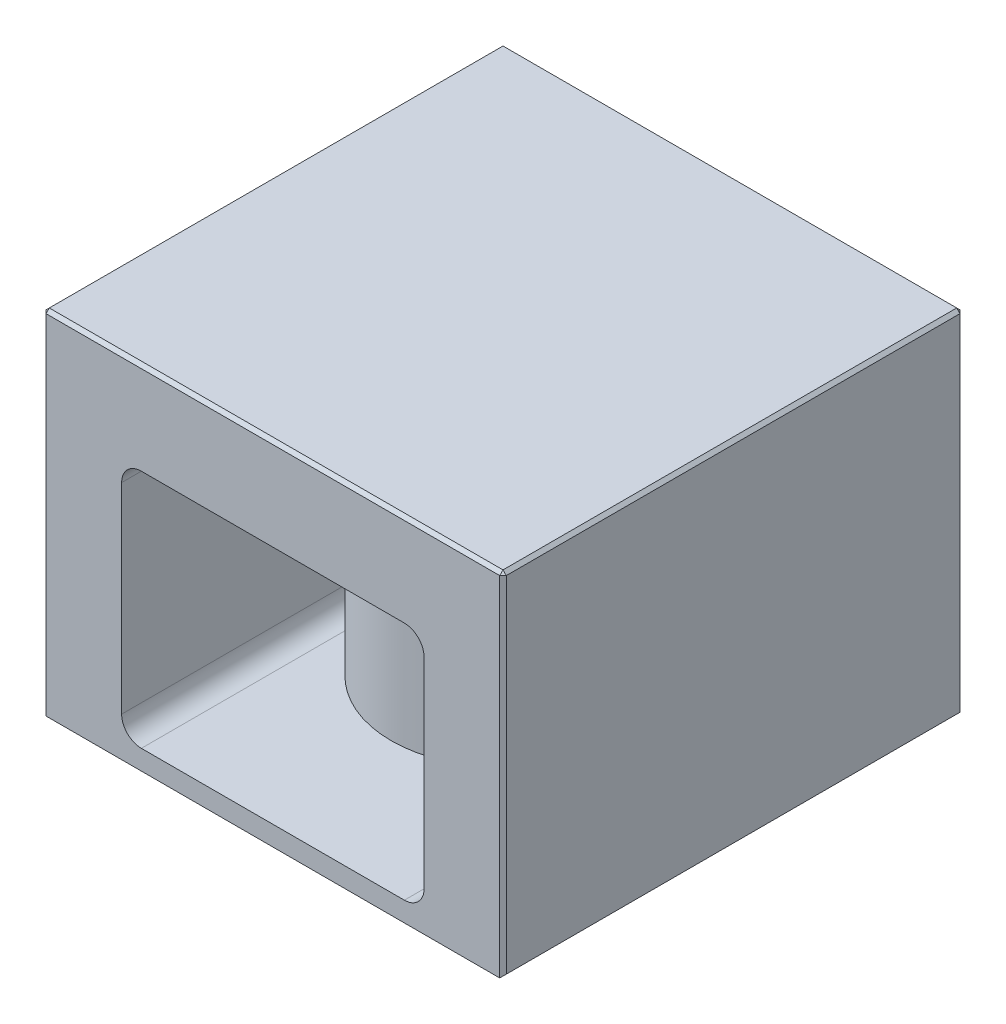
ISO-10303-21;
HEADER;
FILE_DESCRIPTION(('STEP AP214'),'2;1');
FILE_NAME('part.step','',(''),(''),'','','');
FILE_SCHEMA(('AUTOMOTIVE_DESIGN { 1 0 10303 214 1 1 1 1 }'));
ENDSEC;
DATA;
#1=APPLICATION_CONTEXT('core data for automotive mechanical design processes');
#2=APPLICATION_PROTOCOL_DEFINITION('international standard','automotive_design',2000,#1);
#3=PRODUCT_CONTEXT('',#1,'mechanical');
#4=PRODUCT('Part','Part','',(#3));
#5=PRODUCT_RELATED_PRODUCT_CATEGORY('part','',(#4));
#6=PRODUCT_DEFINITION_FORMATION('','',#4);
#7=PRODUCT_DEFINITION_CONTEXT('part definition',#1,'design');
#8=PRODUCT_DEFINITION('design','',#6,#7);
#9=PRODUCT_DEFINITION_SHAPE('','',#8);
#10=(LENGTH_UNIT() NAMED_UNIT(*) SI_UNIT(.MILLI.,.METRE.));
#11=(NAMED_UNIT(*) PLANE_ANGLE_UNIT() SI_UNIT($,.RADIAN.));
#12=(NAMED_UNIT(*) SI_UNIT($,.STERADIAN.) SOLID_ANGLE_UNIT());
#13=UNCERTAINTY_MEASURE_WITH_UNIT(LENGTH_MEASURE(1.E-05),#10,'distance_accuracy_value','');
#14=(GEOMETRIC_REPRESENTATION_CONTEXT(3) GLOBAL_UNCERTAINTY_ASSIGNED_CONTEXT((#13)) GLOBAL_UNIT_ASSIGNED_CONTEXT((#10,
#11,#12)) REPRESENTATION_CONTEXT('',''));
#15=CARTESIAN_POINT('',(0.,0.,0.));
#16=DIRECTION('',(0.,0.,1.));
#17=DIRECTION('',(1.,0.,0.));
#18=AXIS2_PLACEMENT_3D('',#15,#16,#17);
#19=CARTESIAN_POINT('',(0.,-98.5832611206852,0.));
#20=DIRECTION('',(0.,1.,0.));
#21=DIRECTION('',(0.,0.,1.));
#22=AXIS2_PLACEMENT_3D('',#19,#20,#21);
#23=CYLINDRICAL_SURFACE('',#22,17.);
#24=CARTESIAN_POINT('',(0.,-15.5,0.));
#25=DIRECTION('',(0.,-1.,0.));
#26=DIRECTION('',(0.,0.,-1.));
#27=AXIS2_PLACEMENT_3D('',#24,#25,#26);
#28=CIRCLE('',#27,17.);
#29=CARTESIAN_POINT('',(0.,-15.5,-17.));
#30=VERTEX_POINT('',#29);
#31=EDGE_CURVE('E52',#30,#30,#28,.T.);
#32=ORIENTED_EDGE('',*,*,#31,.T.);
#33=EDGE_LOOP('',(#32));
#34=FACE_BOUND('',#33,.T.);
#35=CARTESIAN_POINT('',(0.,-48.5,0.));
#36=DIRECTION('',(0.,-1.,0.));
#37=DIRECTION('',(0.,0.,-1.));
#38=AXIS2_PLACEMENT_3D('',#35,#36,#37);
#39=CIRCLE('',#38,17.);
#40=CARTESIAN_POINT('',(0.,-48.5,-17.));
#41=VERTEX_POINT('',#40);
#42=EDGE_CURVE('E12',#41,#41,#39,.T.);
#43=ORIENTED_EDGE('',*,*,#42,.F.);
#44=EDGE_LOOP('',(#43));
#45=FACE_BOUND('',#44,.T.);
#46=ADVANCED_FACE('F45',(#34,#45),#23,.T.);
#47=CARTESIAN_POINT('',(0.,-15.5,0.));
#48=DIRECTION('',(0.,-1.,0.));
#49=DIRECTION('',(0.,0.,-1.));
#50=AXIS2_PLACEMENT_3D('',#47,#48,#49);
#51=PLANE('',#50);
#52=ORIENTED_EDGE('',*,*,#31,.F.);
#53=EDGE_LOOP('',(#52));
#54=FACE_BOUND('',#53,.T.);
#55=ADVANCED_FACE('F60',(#54),#51,.F.);
#56=CARTESIAN_POINT('',(-20.,-48.5,-93.7218017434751));
#57=DIRECTION('',(0.,-1.,0.));
#58=DIRECTION('',(0.,0.,-1.));
#59=AXIS2_PLACEMENT_3D('',#56,#57,#58);
#60=PLANE('',#59);
#61=ORIENTED_EDGE('',*,*,#42,.T.);
#62=EDGE_LOOP('',(#61));
#63=FACE_BOUND('',#62,.T.);
#64=ADVANCED_FACE('F47',(#63),#60,.T.);
#65=CLOSED_SHELL('',(#46,#55,#64));
#66=MANIFOLD_SOLID_BREP('B2',#65);
#67=CARTESIAN_POINT('',(35.,-53.5,35.));
#68=DIRECTION('',(1.,0.,0.));
#69=DIRECTION('',(0.,0.,-1.));
#70=AXIS2_PLACEMENT_3D('',#67,#68,#69);
#71=PLANE('',#70);
#72=DIRECTION('',(0.,0.,-1.));
#73=VECTOR('',#72,1.);
#74=CARTESIAN_POINT('',(35.,-53.,35.));
#75=LINE('',#74,#73);
#76=CARTESIAN_POINT('',(35.,-53.,34.5));
#77=VERTEX_POINT('',#76);
#78=CARTESIAN_POINT('',(35.,-53.,-34.5));
#79=VERTEX_POINT('',#78);
#80=EDGE_CURVE('E280',#77,#79,#75,.T.);
#81=ORIENTED_EDGE('',*,*,#80,.T.);
#82=DIRECTION('',(0.,1.,0.));
#83=VECTOR('',#82,1.);
#84=CARTESIAN_POINT('',(35.,-53.5,-34.5));
#85=LINE('',#84,#83);
#86=CARTESIAN_POINT('',(35.,-0.500000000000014,-34.5));
#87=VERTEX_POINT('',#86);
#88=EDGE_CURVE('E282',#79,#87,#85,.T.);
#89=ORIENTED_EDGE('',*,*,#88,.T.);
#90=DIRECTION('',(0.,0.,1.));
#91=VECTOR('',#90,1.);
#92=CARTESIAN_POINT('',(35.,-0.500000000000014,35.));
#93=LINE('',#92,#91);
#94=CARTESIAN_POINT('',(35.,-0.500000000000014,34.5));
#95=VERTEX_POINT('',#94);
#96=EDGE_CURVE('E276',#87,#95,#93,.T.);
#97=ORIENTED_EDGE('',*,*,#96,.T.);
#98=DIRECTION('',(0.,-1.,0.));
#99=VECTOR('',#98,1.);
#100=CARTESIAN_POINT('',(35.,-53.5,34.5));
#101=LINE('',#100,#99);
#102=EDGE_CURVE('E278',#95,#77,#101,.T.);
#103=ORIENTED_EDGE('',*,*,#102,.T.);
#104=EDGE_LOOP('',(#81,#89,#97,#103));
#105=FACE_BOUND('',#104,.T.);
#106=ADVANCED_FACE('F86',(#105),#71,.T.);
#107=CARTESIAN_POINT('',(-35.,-53.5,35.));
#108=DIRECTION('',(0.,0.,1.));
#109=DIRECTION('',(1.,0.,0.));
#110=AXIS2_PLACEMENT_3D('',#107,#108,#109);
#111=PLANE('',#110);
#112=DIRECTION('',(1.,0.,0.));
#113=VECTOR('',#112,1.);
#114=CARTESIAN_POINT('',(-35.,-53.5,35.));
#115=LINE('',#114,#113);
#116=CARTESIAN_POINT('',(-34.5,-53.5,35.));
#117=VERTEX_POINT('',#116);
#118=CARTESIAN_POINT('',(34.5,-53.5,35.));
#119=VERTEX_POINT('',#118);
#120=EDGE_CURVE('E273',#117,#119,#115,.T.);
#121=ORIENTED_EDGE('',*,*,#120,.T.);
#122=DIRECTION('',(0.,1.,0.));
#123=VECTOR('',#122,1.);
#124=CARTESIAN_POINT('',(34.5,-53.5,35.));
#125=LINE('',#124,#123);
#126=CARTESIAN_POINT('',(34.5,-0.500000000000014,35.));
#127=VERTEX_POINT('',#126);
#128=EDGE_CURVE('E300',#119,#127,#125,.T.);
#129=ORIENTED_EDGE('',*,*,#128,.T.);
#130=DIRECTION('',(-1.,0.,0.));
#131=VECTOR('',#130,1.);
#132=CARTESIAN_POINT('',(-35.,-0.500000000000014,35.));
#133=LINE('',#132,#131);
#134=CARTESIAN_POINT('',(-34.5,-0.500000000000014,35.));
#135=VERTEX_POINT('',#134);
#136=EDGE_CURVE('E296',#127,#135,#133,.T.);
#137=ORIENTED_EDGE('',*,*,#136,.T.);
#138=DIRECTION('',(0.,-1.,0.));
#139=VECTOR('',#138,1.);
#140=CARTESIAN_POINT('',(-34.5,-53.5,35.));
#141=LINE('',#140,#139);
#142=EDGE_CURVE('E298',#135,#117,#141,.T.);
#143=ORIENTED_EDGE('',*,*,#142,.T.);
#144=EDGE_LOOP('',(#121,#129,#137,#143));
#145=FACE_BOUND('',#144,.T.);
#146=DIRECTION('',(-1.,0.,0.));
#147=VECTOR('',#146,1.);
#148=CARTESIAN_POINT('',(-20.,-14.,35.));
#149=LINE('',#148,#147);
#150=CARTESIAN_POINT('',(20.,-14.,35.));
#151=VERTEX_POINT('',#150);
#152=CARTESIAN_POINT('',(-20.,-14.,35.));
#153=VERTEX_POINT('',#152);
#154=EDGE_CURVE('E227',#151,#153,#149,.T.);
#155=ORIENTED_EDGE('',*,*,#154,.F.);
#156=CARTESIAN_POINT('',(20.,-17.,35.));
#157=DIRECTION('',(0.,0.,1.));
#158=DIRECTION('',(-1.,0.,0.));
#159=AXIS2_PLACEMENT_3D('',#156,#157,#158);
#160=CIRCLE('',#159,3.);
#161=CARTESIAN_POINT('',(23.,-17.,35.));
#162=VERTEX_POINT('',#161);
#163=EDGE_CURVE('E240',#162,#151,#160,.T.);
#164=ORIENTED_EDGE('',*,*,#163,.F.);
#165=DIRECTION('',(0.,1.,0.));
#166=VECTOR('',#165,1.);
#167=CARTESIAN_POINT('',(23.,-47.5,35.));
#168=LINE('',#167,#166);
#169=CARTESIAN_POINT('',(23.,-47.5,35.));
#170=VERTEX_POINT('',#169);
#171=EDGE_CURVE('E234',#170,#162,#168,.T.);
#172=ORIENTED_EDGE('',*,*,#171,.F.);
#173=CARTESIAN_POINT('',(20.,-47.5,35.));
#174=DIRECTION('',(0.,0.,1.));
#175=DIRECTION('',(1.,0.,0.));
#176=AXIS2_PLACEMENT_3D('',#173,#174,#175);
#177=CIRCLE('',#176,3.);
#178=CARTESIAN_POINT('',(20.,-50.5,35.));
#179=VERTEX_POINT('',#178);
#180=EDGE_CURVE('E236',#179,#170,#177,.T.);
#181=ORIENTED_EDGE('',*,*,#180,.F.);
#182=DIRECTION('',(1.,0.,0.));
#183=VECTOR('',#182,1.);
#184=CARTESIAN_POINT('',(-20.,-50.5,35.));
#185=LINE('',#184,#183);
#186=CARTESIAN_POINT('',(-20.,-50.5,35.));
#187=VERTEX_POINT('',#186);
#188=EDGE_CURVE('E376',#187,#179,#185,.T.);
#189=ORIENTED_EDGE('',*,*,#188,.F.);
#190=CARTESIAN_POINT('',(-20.,-47.5,35.));
#191=DIRECTION('',(0.,0.,1.));
#192=DIRECTION('',(-1.,0.,0.));
#193=AXIS2_PLACEMENT_3D('',#190,#191,#192);
#194=CIRCLE('',#193,3.);
#195=CARTESIAN_POINT('',(-23.,-47.5,35.));
#196=VERTEX_POINT('',#195);
#197=EDGE_CURVE('E373',#196,#187,#194,.T.);
#198=ORIENTED_EDGE('',*,*,#197,.F.);
#199=DIRECTION('',(0.,-1.,0.));
#200=VECTOR('',#199,1.);
#201=CARTESIAN_POINT('',(-23.,-47.5,35.));
#202=LINE('',#201,#200);
#203=CARTESIAN_POINT('',(-23.,-17.,35.));
#204=VERTEX_POINT('',#203);
#205=EDGE_CURVE('E368',#204,#196,#202,.T.);
#206=ORIENTED_EDGE('',*,*,#205,.F.);
#207=CARTESIAN_POINT('',(-20.,-17.,35.));
#208=DIRECTION('',(0.,0.,1.));
#209=DIRECTION('',(-1.,0.,0.));
#210=AXIS2_PLACEMENT_3D('',#207,#208,#209);
#211=CIRCLE('',#210,3.);
#212=EDGE_CURVE('E367',#153,#204,#211,.T.);
#213=ORIENTED_EDGE('',*,*,#212,.F.);
#214=EDGE_LOOP('',(#155,#164,#172,#181,#189,#198,#206,#213));
#215=FACE_BOUND('',#214,.T.);
#216=ADVANCED_FACE('F388',(#145,#215),#111,.T.);
#217=CARTESIAN_POINT('',(-35.,-53.5,35.));
#218=DIRECTION('',(-1.,0.,0.));
#219=DIRECTION('',(0.,0.,1.));
#220=AXIS2_PLACEMENT_3D('',#217,#218,#219);
#221=PLANE('',#220);
#222=DIRECTION('',(0.,0.,1.));
#223=VECTOR('',#222,1.);
#224=CARTESIAN_POINT('',(-35.,-53.,35.));
#225=LINE('',#224,#223);
#226=CARTESIAN_POINT('',(-35.,-53.,-34.5));
#227=VERTEX_POINT('',#226);
#228=CARTESIAN_POINT('',(-35.,-53.,34.5));
#229=VERTEX_POINT('',#228);
#230=EDGE_CURVE('E306',#227,#229,#225,.T.);
#231=ORIENTED_EDGE('',*,*,#230,.T.);
#232=DIRECTION('',(0.,1.,0.));
#233=VECTOR('',#232,1.);
#234=CARTESIAN_POINT('',(-35.,-53.5,34.5));
#235=LINE('',#234,#233);
#236=CARTESIAN_POINT('',(-35.,-0.500000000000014,34.5));
#237=VERTEX_POINT('',#236);
#238=EDGE_CURVE('E308',#229,#237,#235,.T.);
#239=ORIENTED_EDGE('',*,*,#238,.T.);
#240=DIRECTION('',(0.,0.,-1.));
#241=VECTOR('',#240,1.);
#242=CARTESIAN_POINT('',(-35.,-0.500000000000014,-35.));
#243=LINE('',#242,#241);
#244=CARTESIAN_POINT('',(-35.,-0.500000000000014,-34.5));
#245=VERTEX_POINT('',#244);
#246=EDGE_CURVE('E302',#237,#245,#243,.T.);
#247=ORIENTED_EDGE('',*,*,#246,.T.);
#248=DIRECTION('',(0.,-1.,0.));
#249=VECTOR('',#248,1.);
#250=CARTESIAN_POINT('',(-35.,-53.5,-34.5));
#251=LINE('',#250,#249);
#252=EDGE_CURVE('E304',#245,#227,#251,.T.);
#253=ORIENTED_EDGE('',*,*,#252,.T.);
#254=EDGE_LOOP('',(#231,#239,#247,#253));
#255=FACE_BOUND('',#254,.T.);
#256=ADVANCED_FACE('F408',(#255),#221,.T.);
#257=CARTESIAN_POINT('',(-35.,-53.5,-35.));
#258=DIRECTION('',(0.,0.,-1.));
#259=DIRECTION('',(-1.,0.,0.));
#260=AXIS2_PLACEMENT_3D('',#257,#258,#259);
#261=PLANE('',#260);
#262=DIRECTION('',(-1.,0.,0.));
#263=VECTOR('',#262,1.);
#264=CARTESIAN_POINT('',(-20.,-14.,-35.));
#265=LINE('',#264,#263);
#266=CARTESIAN_POINT('',(20.,-14.,-35.));
#267=VERTEX_POINT('',#266);
#268=CARTESIAN_POINT('',(-20.,-14.,-35.));
#269=VERTEX_POINT('',#268);
#270=EDGE_CURVE('E224',#267,#269,#265,.T.);
#271=ORIENTED_EDGE('',*,*,#270,.T.);
#272=CARTESIAN_POINT('',(-20.,-17.,-35.));
#273=DIRECTION('',(0.,0.,-1.));
#274=DIRECTION('',(-1.,0.,0.));
#275=AXIS2_PLACEMENT_3D('',#272,#273,#274);
#276=CIRCLE('',#275,3.);
#277=CARTESIAN_POINT('',(-23.,-17.,-35.));
#278=VERTEX_POINT('',#277);
#279=EDGE_CURVE('E210',#269,#278,#276,.F.);
#280=ORIENTED_EDGE('',*,*,#279,.T.);
#281=DIRECTION('',(0.,-1.,0.));
#282=VECTOR('',#281,1.);
#283=CARTESIAN_POINT('',(-23.,-47.5,-35.));
#284=LINE('',#283,#282);
#285=CARTESIAN_POINT('',(-23.,-47.5,-35.));
#286=VERTEX_POINT('',#285);
#287=EDGE_CURVE('E260',#278,#286,#284,.T.);
#288=ORIENTED_EDGE('',*,*,#287,.T.);
#289=CARTESIAN_POINT('',(-20.,-47.5,-35.));
#290=DIRECTION('',(0.,0.,-1.));
#291=DIRECTION('',(-1.,0.,0.));
#292=AXIS2_PLACEMENT_3D('',#289,#290,#291);
#293=CIRCLE('',#292,3.);
#294=CARTESIAN_POINT('',(-20.,-50.5,-35.));
#295=VERTEX_POINT('',#294);
#296=EDGE_CURVE('E256',#286,#295,#293,.F.);
#297=ORIENTED_EDGE('',*,*,#296,.T.);
#298=DIRECTION('',(1.,0.,0.));
#299=VECTOR('',#298,1.);
#300=CARTESIAN_POINT('',(-20.,-50.5,-35.));
#301=LINE('',#300,#299);
#302=CARTESIAN_POINT('',(20.,-50.5,-35.));
#303=VERTEX_POINT('',#302);
#304=EDGE_CURVE('E252',#295,#303,#301,.T.);
#305=ORIENTED_EDGE('',*,*,#304,.T.);
#306=CARTESIAN_POINT('',(20.,-47.5,-35.));
#307=DIRECTION('',(0.,0.,-1.));
#308=DIRECTION('',(-1.,0.,0.));
#309=AXIS2_PLACEMENT_3D('',#306,#307,#308);
#310=CIRCLE('',#309,3.);
#311=CARTESIAN_POINT('',(23.,-47.5,-35.));
#312=VERTEX_POINT('',#311);
#313=EDGE_CURVE('E248',#303,#312,#310,.F.);
#314=ORIENTED_EDGE('',*,*,#313,.T.);
#315=DIRECTION('',(0.,1.,0.));
#316=VECTOR('',#315,1.);
#317=CARTESIAN_POINT('',(23.,-47.5,-35.));
#318=LINE('',#317,#316);
#319=CARTESIAN_POINT('',(23.,-17.,-35.));
#320=VERTEX_POINT('',#319);
#321=EDGE_CURVE('E245',#312,#320,#318,.T.);
#322=ORIENTED_EDGE('',*,*,#321,.T.);
#323=CARTESIAN_POINT('',(20.,-17.,-35.));
#324=DIRECTION('',(0.,0.,-1.));
#325=DIRECTION('',(-1.,0.,0.));
#326=AXIS2_PLACEMENT_3D('',#323,#324,#325);
#327=CIRCLE('',#326,3.);
#328=EDGE_CURVE('E233',#320,#267,#327,.F.);
#329=ORIENTED_EDGE('',*,*,#328,.T.);
#330=EDGE_LOOP('',(#271,#280,#288,#297,#305,#314,#322,#329));
#331=FACE_BOUND('',#330,.T.);
#332=DIRECTION('',(1.,0.,0.));
#333=VECTOR('',#332,1.);
#334=CARTESIAN_POINT('',(35.,-0.500000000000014,-35.));
#335=LINE('',#334,#333);
#336=CARTESIAN_POINT('',(-34.5,-0.500000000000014,-35.));
#337=VERTEX_POINT('',#336);
#338=CARTESIAN_POINT('',(34.5,-0.500000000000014,-35.));
#339=VERTEX_POINT('',#338);
#340=EDGE_CURVE('E285',#337,#339,#335,.T.);
#341=ORIENTED_EDGE('',*,*,#340,.T.);
#342=DIRECTION('',(0.,-1.,0.));
#343=VECTOR('',#342,1.);
#344=CARTESIAN_POINT('',(34.5,-53.5,-35.));
#345=LINE('',#344,#343);
#346=CARTESIAN_POINT('',(34.5,-53.5,-35.));
#347=VERTEX_POINT('',#346);
#348=EDGE_CURVE('E289',#339,#347,#345,.T.);
#349=ORIENTED_EDGE('',*,*,#348,.T.);
#350=DIRECTION('',(-1.,0.,0.));
#351=VECTOR('',#350,1.);
#352=CARTESIAN_POINT('',(-35.,-53.5,-35.));
#353=LINE('',#352,#351);
#354=CARTESIAN_POINT('',(-34.5,-53.5,-35.));
#355=VERTEX_POINT('',#354);
#356=EDGE_CURVE('E270',#347,#355,#353,.T.);
#357=ORIENTED_EDGE('',*,*,#356,.T.);
#358=DIRECTION('',(0.,1.,0.));
#359=VECTOR('',#358,1.);
#360=CARTESIAN_POINT('',(-34.5,-53.5,-35.));
#361=LINE('',#360,#359);
#362=EDGE_CURVE('E287',#355,#337,#361,.T.);
#363=ORIENTED_EDGE('',*,*,#362,.T.);
#364=EDGE_LOOP('',(#341,#349,#357,#363));
#365=FACE_BOUND('',#364,.T.);
#366=ADVANCED_FACE('F230',(#331,#365),#261,.T.);
#367=CARTESIAN_POINT('',(0.,-53.5,0.));
#368=DIRECTION('',(0.,-1.,0.));
#369=DIRECTION('',(0.,0.,-1.));
#370=AXIS2_PLACEMENT_3D('',#367,#368,#369);
#371=PLANE('',#370);
#372=ORIENTED_EDGE('',*,*,#356,.F.);
#373=DIRECTION('',(0.,0.,1.));
#374=VECTOR('',#373,1.);
#375=CARTESIAN_POINT('',(34.5,-53.5,0.));
#376=LINE('',#375,#374);
#377=EDGE_CURVE('E294',#347,#119,#376,.T.);
#378=ORIENTED_EDGE('',*,*,#377,.T.);
#379=ORIENTED_EDGE('',*,*,#120,.F.);
#380=DIRECTION('',(0.,0.,-1.));
#381=VECTOR('',#380,1.);
#382=CARTESIAN_POINT('',(-34.5,-53.5,0.));
#383=LINE('',#382,#381);
#384=EDGE_CURVE('E292',#117,#355,#383,.T.);
#385=ORIENTED_EDGE('',*,*,#384,.T.);
#386=EDGE_LOOP('',(#372,#378,#379,#385));
#387=FACE_BOUND('',#386,.T.);
#388=ADVANCED_FACE('F478',(#387),#371,.T.);
#389=CARTESIAN_POINT('',(0.,0.,0.));
#390=DIRECTION('',(0.,-1.,0.));
#391=DIRECTION('',(0.,0.,-1.));
#392=AXIS2_PLACEMENT_3D('',#389,#390,#391);
#393=PLANE('',#392);
#394=DIRECTION('',(0.,0.,1.));
#395=VECTOR('',#394,1.);
#396=CARTESIAN_POINT('',(-34.5,0.,35.));
#397=LINE('',#396,#395);
#398=CARTESIAN_POINT('',(-34.5,0.,-34.5));
#399=VERTEX_POINT('',#398);
#400=CARTESIAN_POINT('',(-34.5,0.,34.5));
#401=VERTEX_POINT('',#400);
#402=EDGE_CURVE('E95',#399,#401,#397,.T.);
#403=ORIENTED_EDGE('',*,*,#402,.T.);
#404=DIRECTION('',(1.,0.,0.));
#405=VECTOR('',#404,1.);
#406=CARTESIAN_POINT('',(35.,0.,34.5));
#407=LINE('',#406,#405);
#408=CARTESIAN_POINT('',(34.5,0.,34.5));
#409=VERTEX_POINT('',#408);
#410=EDGE_CURVE('E43',#401,#409,#407,.T.);
#411=ORIENTED_EDGE('',*,*,#410,.T.);
#412=DIRECTION('',(0.,0.,-1.));
#413=VECTOR('',#412,1.);
#414=CARTESIAN_POINT('',(34.5,0.,-35.));
#415=LINE('',#414,#413);
#416=CARTESIAN_POINT('',(34.5,0.,-34.5));
#417=VERTEX_POINT('',#416);
#418=EDGE_CURVE('E311',#409,#417,#415,.T.);
#419=ORIENTED_EDGE('',*,*,#418,.T.);
#420=DIRECTION('',(-1.,0.,0.));
#421=VECTOR('',#420,1.);
#422=CARTESIAN_POINT('',(-35.,0.,-34.5));
#423=LINE('',#422,#421);
#424=EDGE_CURVE('E106',#417,#399,#423,.T.);
#425=ORIENTED_EDGE('',*,*,#424,.T.);
#426=EDGE_LOOP('',(#403,#411,#419,#425));
#427=FACE_BOUND('',#426,.T.);
#428=ADVANCED_FACE('F493',(#427),#393,.F.);
#429=CARTESIAN_POINT('',(-20.,-14.,-93.7218017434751));
#430=DIRECTION('',(0.,1.,0.));
#431=DIRECTION('',(0.,0.,1.));
#432=AXIS2_PLACEMENT_3D('',#429,#430,#431);
#433=PLANE('',#432);
#434=DIRECTION('',(0.,0.,1.));
#435=VECTOR('',#434,1.);
#436=CARTESIAN_POINT('',(20.,-14.,-93.7218017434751));
#437=LINE('',#436,#435);
#438=EDGE_CURVE('E243',#267,#151,#437,.T.);
#439=ORIENTED_EDGE('',*,*,#438,.T.);
#440=ORIENTED_EDGE('',*,*,#154,.T.);
#441=DIRECTION('',(0.,0.,1.));
#442=VECTOR('',#441,1.);
#443=CARTESIAN_POINT('',(-20.,-14.,-93.7218017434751));
#444=LINE('',#443,#442);
#445=EDGE_CURVE('E214',#269,#153,#444,.T.);
#446=ORIENTED_EDGE('',*,*,#445,.F.);
#447=ORIENTED_EDGE('',*,*,#270,.F.);
#448=EDGE_LOOP('',(#439,#440,#446,#447));
#449=FACE_BOUND('',#448,.T.);
#450=ADVANCED_FACE('F223',(#449),#433,.F.);
#451=CARTESIAN_POINT('',(-20.,-17.,-93.7218017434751));
#452=DIRECTION('',(0.,0.,1.));
#453=DIRECTION('',(1.,0.,0.));
#454=AXIS2_PLACEMENT_3D('',#451,#452,#453);
#455=CYLINDRICAL_SURFACE('',#454,3.);
#456=ORIENTED_EDGE('',*,*,#445,.T.);
#457=ORIENTED_EDGE('',*,*,#212,.T.);
#458=DIRECTION('',(0.,0.,1.));
#459=VECTOR('',#458,1.);
#460=CARTESIAN_POINT('',(-23.,-17.,-93.7218017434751));
#461=LINE('',#460,#459);
#462=EDGE_CURVE('E216',#278,#204,#461,.T.);
#463=ORIENTED_EDGE('',*,*,#462,.F.);
#464=ORIENTED_EDGE('',*,*,#279,.F.);
#465=EDGE_LOOP('',(#456,#457,#463,#464));
#466=FACE_BOUND('',#465,.T.);
#467=ADVANCED_FACE('F212',(#466),#455,.F.);
#468=CARTESIAN_POINT('',(-23.,-47.5,-93.7218017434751));
#469=DIRECTION('',(-1.,0.,0.));
#470=DIRECTION('',(0.,0.,1.));
#471=AXIS2_PLACEMENT_3D('',#468,#469,#470);
#472=PLANE('',#471);
#473=ORIENTED_EDGE('',*,*,#462,.T.);
#474=ORIENTED_EDGE('',*,*,#205,.T.);
#475=DIRECTION('',(0.,0.,1.));
#476=VECTOR('',#475,1.);
#477=CARTESIAN_POINT('',(-23.,-47.5,-93.7218017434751));
#478=LINE('',#477,#476);
#479=EDGE_CURVE('E259',#286,#196,#478,.T.);
#480=ORIENTED_EDGE('',*,*,#479,.F.);
#481=ORIENTED_EDGE('',*,*,#287,.F.);
#482=EDGE_LOOP('',(#473,#474,#480,#481));
#483=FACE_BOUND('',#482,.T.);
#484=ADVANCED_FACE('F636',(#483),#472,.F.);
#485=CARTESIAN_POINT('',(-20.,-47.5,-93.7218017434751));
#486=DIRECTION('',(0.,0.,1.));
#487=DIRECTION('',(1.,0.,0.));
#488=AXIS2_PLACEMENT_3D('',#485,#486,#487);
#489=CYLINDRICAL_SURFACE('',#488,3.);
#490=ORIENTED_EDGE('',*,*,#479,.T.);
#491=ORIENTED_EDGE('',*,*,#197,.T.);
#492=DIRECTION('',(0.,0.,1.));
#493=VECTOR('',#492,1.);
#494=CARTESIAN_POINT('',(-20.,-50.5,-93.7218017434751));
#495=LINE('',#494,#493);
#496=EDGE_CURVE('E255',#295,#187,#495,.T.);
#497=ORIENTED_EDGE('',*,*,#496,.F.);
#498=ORIENTED_EDGE('',*,*,#296,.F.);
#499=EDGE_LOOP('',(#490,#491,#497,#498));
#500=FACE_BOUND('',#499,.T.);
#501=ADVANCED_FACE('F627',(#500),#489,.F.);
#502=CARTESIAN_POINT('',(-20.,-50.5,-93.7218017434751));
#503=DIRECTION('',(0.,-1.,0.));
#504=DIRECTION('',(0.,0.,-1.));
#505=AXIS2_PLACEMENT_3D('',#502,#503,#504);
#506=PLANE('',#505);
#507=ORIENTED_EDGE('',*,*,#496,.T.);
#508=ORIENTED_EDGE('',*,*,#188,.T.);
#509=DIRECTION('',(0.,0.,1.));
#510=VECTOR('',#509,1.);
#511=CARTESIAN_POINT('',(20.,-50.5,-93.7218017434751));
#512=LINE('',#511,#510);
#513=EDGE_CURVE('E251',#303,#179,#512,.T.);
#514=ORIENTED_EDGE('',*,*,#513,.F.);
#515=ORIENTED_EDGE('',*,*,#304,.F.);
#516=EDGE_LOOP('',(#507,#508,#514,#515));
#517=FACE_BOUND('',#516,.T.);
#518=ADVANCED_FACE('F619',(#517),#506,.F.);
#519=CARTESIAN_POINT('',(20.,-47.5,-93.7218017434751));
#520=DIRECTION('',(0.,0.,1.));
#521=DIRECTION('',(1.,0.,0.));
#522=AXIS2_PLACEMENT_3D('',#519,#520,#521);
#523=CYLINDRICAL_SURFACE('',#522,3.);
#524=ORIENTED_EDGE('',*,*,#513,.T.);
#525=ORIENTED_EDGE('',*,*,#180,.T.);
#526=DIRECTION('',(0.,0.,1.));
#527=VECTOR('',#526,1.);
#528=CARTESIAN_POINT('',(23.,-47.5,-93.7218017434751));
#529=LINE('',#528,#527);
#530=EDGE_CURVE('E247',#312,#170,#529,.T.);
#531=ORIENTED_EDGE('',*,*,#530,.F.);
#532=ORIENTED_EDGE('',*,*,#313,.F.);
#533=EDGE_LOOP('',(#524,#525,#531,#532));
#534=FACE_BOUND('',#533,.T.);
#535=ADVANCED_FACE('F384',(#534),#523,.F.);
#536=CARTESIAN_POINT('',(23.,-47.5,-93.7218017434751));
#537=DIRECTION('',(1.,0.,0.));
#538=DIRECTION('',(0.,0.,-1.));
#539=AXIS2_PLACEMENT_3D('',#536,#537,#538);
#540=PLANE('',#539);
#541=ORIENTED_EDGE('',*,*,#530,.T.);
#542=ORIENTED_EDGE('',*,*,#171,.T.);
#543=DIRECTION('',(0.,0.,1.));
#544=VECTOR('',#543,1.);
#545=CARTESIAN_POINT('',(23.,-17.,-93.7218017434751));
#546=LINE('',#545,#544);
#547=EDGE_CURVE('E244',#320,#162,#546,.T.);
#548=ORIENTED_EDGE('',*,*,#547,.F.);
#549=ORIENTED_EDGE('',*,*,#321,.F.);
#550=EDGE_LOOP('',(#541,#542,#548,#549));
#551=FACE_BOUND('',#550,.T.);
#552=ADVANCED_FACE('F391',(#551),#540,.F.);
#553=CARTESIAN_POINT('',(20.,-17.,-93.7218017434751));
#554=DIRECTION('',(0.,0.,1.));
#555=DIRECTION('',(1.,0.,0.));
#556=AXIS2_PLACEMENT_3D('',#553,#554,#555);
#557=CYLINDRICAL_SURFACE('',#556,3.);
#558=ORIENTED_EDGE('',*,*,#547,.T.);
#559=ORIENTED_EDGE('',*,*,#163,.T.);
#560=ORIENTED_EDGE('',*,*,#438,.F.);
#561=ORIENTED_EDGE('',*,*,#328,.F.);
#562=EDGE_LOOP('',(#558,#559,#560,#561));
#563=FACE_BOUND('',#562,.T.);
#564=ADVANCED_FACE('F392',(#563),#557,.F.);
#565=CARTESIAN_POINT('',(-35.,-53.5,34.5));
#566=DIRECTION('',(0.707106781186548,0.,-0.707106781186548));
#567=DIRECTION('',(0.,1.,0.));
#568=AXIS2_PLACEMENT_3D('',#565,#566,#567);
#569=PLANE('',#568);
#570=DIRECTION('',(-0.707106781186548,0.,-0.707106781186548));
#571=VECTOR('',#570,1.);
#572=CARTESIAN_POINT('',(-35.,-0.500000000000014,34.5));
#573=LINE('',#572,#571);
#574=EDGE_CURVE('E90',#237,#135,#573,.F.);
#575=ORIENTED_EDGE('',*,*,#574,.F.);
#576=ORIENTED_EDGE('',*,*,#238,.F.);
#577=DIRECTION('',(-0.577350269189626,0.577350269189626,-0.577350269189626));
#578=VECTOR('',#577,1.);
#579=CARTESIAN_POINT('',(-34.8333333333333,-53.1666666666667,34.6666666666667));
#580=LINE('',#579,#578);
#581=EDGE_CURVE('E353',#117,#229,#580,.T.);
#582=ORIENTED_EDGE('',*,*,#581,.F.);
#583=ORIENTED_EDGE('',*,*,#142,.F.);
#584=EDGE_LOOP('',(#575,#576,#582,#583));
#585=FACE_BOUND('',#584,.T.);
#586=ADVANCED_FACE('F88',(#585),#569,.F.);
#587=CARTESIAN_POINT('',(-35.,-0.500000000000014,34.5));
#588=DIRECTION('',(-0.577350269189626,0.577350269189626,0.577350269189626));
#589=DIRECTION('',(0.707106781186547,0.,0.707106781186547));
#590=AXIS2_PLACEMENT_3D('',#587,#588,#589);
#591=PLANE('',#590);
#592=DIRECTION('',(-0.707106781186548,-0.707106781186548,0.));
#593=VECTOR('',#592,1.);
#594=CARTESIAN_POINT('',(-35.,-0.500000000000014,34.5));
#595=LINE('',#594,#593);
#596=EDGE_CURVE('E349',#237,#401,#595,.F.);
#597=ORIENTED_EDGE('',*,*,#596,.F.);
#598=ORIENTED_EDGE('',*,*,#574,.T.);
#599=DIRECTION('',(0.,0.707106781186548,-0.707106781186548));
#600=VECTOR('',#599,1.);
#601=CARTESIAN_POINT('',(-34.5,-0.250000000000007,34.75));
#602=LINE('',#601,#600);
#603=EDGE_CURVE('E351',#401,#135,#602,.F.);
#604=ORIENTED_EDGE('',*,*,#603,.F.);
#605=EDGE_LOOP('',(#597,#598,#604));
#606=FACE_BOUND('',#605,.T.);
#607=ADVANCED_FACE('F399',(#606),#591,.T.);
#608=CARTESIAN_POINT('',(-35.,-53.,35.));
#609=DIRECTION('',(0.707106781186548,0.707106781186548,0.));
#610=DIRECTION('',(0.,0.,1.));
#611=AXIS2_PLACEMENT_3D('',#608,#609,#610);
#612=PLANE('',#611);
#613=ORIENTED_EDGE('',*,*,#581,.T.);
#614=ORIENTED_EDGE('',*,*,#230,.F.);
#615=DIRECTION('',(-0.577350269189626,0.577350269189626,0.577350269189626));
#616=VECTOR('',#615,1.);
#617=CARTESIAN_POINT('',(-34.5,-53.5,-35.));
#618=LINE('',#617,#616);
#619=EDGE_CURVE('E346',#355,#227,#618,.T.);
#620=ORIENTED_EDGE('',*,*,#619,.F.);
#621=ORIENTED_EDGE('',*,*,#384,.F.);
#622=EDGE_LOOP('',(#613,#614,#620,#621));
#623=FACE_BOUND('',#622,.T.);
#624=ADVANCED_FACE('F457',(#623),#612,.F.);
#625=CARTESIAN_POINT('',(0.,0.,34.5));
#626=DIRECTION('',(0.,0.707106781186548,0.707106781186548));
#627=DIRECTION('',(-1.,0.,0.));
#628=AXIS2_PLACEMENT_3D('',#625,#626,#627);
#629=PLANE('',#628);
#630=ORIENTED_EDGE('',*,*,#603,.T.);
#631=ORIENTED_EDGE('',*,*,#136,.F.);
#632=DIRECTION('',(0.,-0.707106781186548,0.707106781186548));
#633=VECTOR('',#632,1.);
#634=CARTESIAN_POINT('',(34.5,-0.500000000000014,35.));
#635=LINE('',#634,#633);
#636=EDGE_CURVE('E343',#409,#127,#635,.T.);
#637=ORIENTED_EDGE('',*,*,#636,.F.);
#638=ORIENTED_EDGE('',*,*,#410,.F.);
#639=EDGE_LOOP('',(#630,#631,#637,#638));
#640=FACE_BOUND('',#639,.T.);
#641=ADVANCED_FACE('F453',(#640),#629,.T.);
#642=CARTESIAN_POINT('',(-34.5,0.,0.));
#643=DIRECTION('',(-0.707106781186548,0.707106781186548,0.));
#644=DIRECTION('',(0.,0.,-1.));
#645=AXIS2_PLACEMENT_3D('',#642,#643,#644);
#646=PLANE('',#645);
#647=ORIENTED_EDGE('',*,*,#596,.T.);
#648=ORIENTED_EDGE('',*,*,#402,.F.);
#649=DIRECTION('',(0.707106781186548,0.707106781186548,0.));
#650=VECTOR('',#649,1.);
#651=CARTESIAN_POINT('',(-34.75,-0.250000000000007,-34.5));
#652=LINE('',#651,#650);
#653=EDGE_CURVE('E340',#245,#399,#652,.T.);
#654=ORIENTED_EDGE('',*,*,#653,.F.);
#655=ORIENTED_EDGE('',*,*,#246,.F.);
#656=EDGE_LOOP('',(#647,#648,#654,#655));
#657=FACE_BOUND('',#656,.T.);
#658=ADVANCED_FACE('F449',(#657),#646,.T.);
#659=CARTESIAN_POINT('',(-34.5,-53.5,-35.));
#660=DIRECTION('',(0.707106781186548,0.,0.707106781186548));
#661=DIRECTION('',(0.,1.,0.));
#662=AXIS2_PLACEMENT_3D('',#659,#660,#661);
#663=PLANE('',#662);
#664=ORIENTED_EDGE('',*,*,#619,.T.);
#665=ORIENTED_EDGE('',*,*,#252,.F.);
#666=DIRECTION('',(0.707106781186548,0.,-0.707106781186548));
#667=VECTOR('',#666,1.);
#668=CARTESIAN_POINT('',(-34.5,-0.500000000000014,-35.));
#669=LINE('',#668,#667);
#670=EDGE_CURVE('E337',#337,#245,#669,.F.);
#671=ORIENTED_EDGE('',*,*,#670,.F.);
#672=ORIENTED_EDGE('',*,*,#362,.F.);
#673=EDGE_LOOP('',(#664,#665,#671,#672));
#674=FACE_BOUND('',#673,.T.);
#675=ADVANCED_FACE('F445',(#674),#663,.F.);
#676=CARTESIAN_POINT('',(34.5,-0.500000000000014,35.));
#677=DIRECTION('',(0.577350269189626,0.577350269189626,0.577350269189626));
#678=DIRECTION('',(0.707106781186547,0.,-0.707106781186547));
#679=AXIS2_PLACEMENT_3D('',#676,#677,#678);
#680=PLANE('',#679);
#681=DIRECTION('',(-0.707106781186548,0.707106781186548,0.));
#682=VECTOR('',#681,1.);
#683=CARTESIAN_POINT('',(34.75,-0.250000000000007,34.5));
#684=LINE('',#683,#682);
#685=EDGE_CURVE('E331',#409,#95,#684,.F.);
#686=ORIENTED_EDGE('',*,*,#685,.F.);
#687=ORIENTED_EDGE('',*,*,#636,.T.);
#688=DIRECTION('',(-0.707106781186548,0.,0.707106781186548));
#689=VECTOR('',#688,1.);
#690=CARTESIAN_POINT('',(34.5,-0.500000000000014,35.));
#691=LINE('',#690,#689);
#692=EDGE_CURVE('E334',#95,#127,#691,.T.);
#693=ORIENTED_EDGE('',*,*,#692,.F.);
#694=EDGE_LOOP('',(#686,#687,#693));
#695=FACE_BOUND('',#694,.T.);
#696=ADVANCED_FACE('F441',(#695),#680,.T.);
#697=CARTESIAN_POINT('',(-34.5,-0.500000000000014,-35.));
#698=DIRECTION('',(-0.577350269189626,0.577350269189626,-0.577350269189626));
#699=DIRECTION('',(-0.707106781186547,0.,0.707106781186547));
#700=AXIS2_PLACEMENT_3D('',#697,#698,#699);
#701=PLANE('',#700);
#702=ORIENTED_EDGE('',*,*,#670,.T.);
#703=ORIENTED_EDGE('',*,*,#653,.T.);
#704=DIRECTION('',(0.,-0.707106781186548,-0.707106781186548));
#705=VECTOR('',#704,1.);
#706=CARTESIAN_POINT('',(-34.5,-0.500000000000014,-35.));
#707=LINE('',#706,#705);
#708=EDGE_CURVE('E328',#337,#399,#707,.F.);
#709=ORIENTED_EDGE('',*,*,#708,.F.);
#710=EDGE_LOOP('',(#702,#703,#709));
#711=FACE_BOUND('',#710,.T.);
#712=ADVANCED_FACE('F437',(#711),#701,.T.);
#713=CARTESIAN_POINT('',(34.5,-53.5,35.));
#714=DIRECTION('',(-0.707106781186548,0.,-0.707106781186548));
#715=DIRECTION('',(0.,1.,0.));
#716=AXIS2_PLACEMENT_3D('',#713,#714,#715);
#717=PLANE('',#716);
#718=ORIENTED_EDGE('',*,*,#692,.T.);
#719=ORIENTED_EDGE('',*,*,#128,.F.);
#720=DIRECTION('',(0.577350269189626,0.577350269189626,-0.577350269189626));
#721=VECTOR('',#720,1.);
#722=CARTESIAN_POINT('',(34.5,-53.5,35.));
#723=LINE('',#722,#721);
#724=EDGE_CURVE('E325',#77,#119,#723,.F.);
#725=ORIENTED_EDGE('',*,*,#724,.F.);
#726=ORIENTED_EDGE('',*,*,#102,.F.);
#727=EDGE_LOOP('',(#718,#719,#725,#726));
#728=FACE_BOUND('',#727,.T.);
#729=ADVANCED_FACE('F433',(#728),#717,.F.);
#730=CARTESIAN_POINT('',(34.5,0.,0.));
#731=DIRECTION('',(0.707106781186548,0.707106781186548,0.));
#732=DIRECTION('',(0.,0.,1.));
#733=AXIS2_PLACEMENT_3D('',#730,#731,#732);
#734=PLANE('',#733);
#735=ORIENTED_EDGE('',*,*,#685,.T.);
#736=ORIENTED_EDGE('',*,*,#96,.F.);
#737=DIRECTION('',(0.707106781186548,-0.707106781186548,0.));
#738=VECTOR('',#737,1.);
#739=CARTESIAN_POINT('',(35.,-0.500000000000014,-34.5));
#740=LINE('',#739,#738);
#741=EDGE_CURVE('E322',#417,#87,#740,.T.);
#742=ORIENTED_EDGE('',*,*,#741,.F.);
#743=ORIENTED_EDGE('',*,*,#418,.F.);
#744=EDGE_LOOP('',(#735,#736,#742,#743));
#745=FACE_BOUND('',#744,.T.);
#746=ADVANCED_FACE('F429',(#745),#734,.T.);
#747=CARTESIAN_POINT('',(0.,0.,-34.5));
#748=DIRECTION('',(0.,0.707106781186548,-0.707106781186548));
#749=DIRECTION('',(1.,0.,0.));
#750=AXIS2_PLACEMENT_3D('',#747,#748,#749);
#751=PLANE('',#750);
#752=ORIENTED_EDGE('',*,*,#708,.T.);
#753=ORIENTED_EDGE('',*,*,#424,.F.);
#754=DIRECTION('',(0.,0.707106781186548,0.707106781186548));
#755=VECTOR('',#754,1.);
#756=CARTESIAN_POINT('',(34.5,-0.250000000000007,-34.75));
#757=LINE('',#756,#755);
#758=EDGE_CURVE('E319',#339,#417,#757,.T.);
#759=ORIENTED_EDGE('',*,*,#758,.F.);
#760=ORIENTED_EDGE('',*,*,#340,.F.);
#761=EDGE_LOOP('',(#752,#753,#759,#760));
#762=FACE_BOUND('',#761,.T.);
#763=ADVANCED_FACE('F425',(#762),#751,.T.);
#764=CARTESIAN_POINT('',(35.,-53.,35.));
#765=DIRECTION('',(-0.707106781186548,0.707106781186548,0.));
#766=DIRECTION('',(0.,0.,-1.));
#767=AXIS2_PLACEMENT_3D('',#764,#765,#766);
#768=PLANE('',#767);
#769=ORIENTED_EDGE('',*,*,#724,.T.);
#770=ORIENTED_EDGE('',*,*,#377,.F.);
#771=DIRECTION('',(0.577350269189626,0.577350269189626,0.577350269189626));
#772=VECTOR('',#771,1.);
#773=CARTESIAN_POINT('',(58.1666666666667,-29.8333333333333,-11.3333333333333));
#774=LINE('',#773,#772);
#775=EDGE_CURVE('E317',#79,#347,#774,.F.);
#776=ORIENTED_EDGE('',*,*,#775,.F.);
#777=ORIENTED_EDGE('',*,*,#80,.F.);
#778=EDGE_LOOP('',(#769,#770,#776,#777));
#779=FACE_BOUND('',#778,.T.);
#780=ADVANCED_FACE('F421',(#779),#768,.F.);
#781=CARTESIAN_POINT('',(35.,-0.500000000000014,-34.5));
#782=DIRECTION('',(0.577350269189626,0.577350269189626,-0.577350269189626));
#783=DIRECTION('',(-0.707106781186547,0.,-0.707106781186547));
#784=AXIS2_PLACEMENT_3D('',#781,#782,#783);
#785=PLANE('',#784);
#786=ORIENTED_EDGE('',*,*,#758,.T.);
#787=ORIENTED_EDGE('',*,*,#741,.T.);
#788=DIRECTION('',(0.707106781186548,0.,0.707106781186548));
#789=VECTOR('',#788,1.);
#790=CARTESIAN_POINT('',(35.,-0.500000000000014,-34.5));
#791=LINE('',#790,#789);
#792=EDGE_CURVE('E315',#339,#87,#791,.T.);
#793=ORIENTED_EDGE('',*,*,#792,.F.);
#794=EDGE_LOOP('',(#786,#787,#793));
#795=FACE_BOUND('',#794,.T.);
#796=ADVANCED_FACE('F417',(#795),#785,.T.);
#797=CARTESIAN_POINT('',(35.,-53.5,-34.5));
#798=DIRECTION('',(-0.707106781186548,0.,0.707106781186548));
#799=DIRECTION('',(0.,1.,0.));
#800=AXIS2_PLACEMENT_3D('',#797,#798,#799);
#801=PLANE('',#800);
#802=ORIENTED_EDGE('',*,*,#775,.T.);
#803=ORIENTED_EDGE('',*,*,#348,.F.);
#804=ORIENTED_EDGE('',*,*,#792,.T.);
#805=ORIENTED_EDGE('',*,*,#88,.F.);
#806=EDGE_LOOP('',(#802,#803,#804,#805));
#807=FACE_BOUND('',#806,.T.);
#808=ADVANCED_FACE('F414',(#807),#801,.F.);
#809=CLOSED_SHELL('',(#106,#216,#256,#366,#388,#428,#450,#467,#484,#501,#518,#535,#552,#564,
#586,#607,#624,#641,#658,#675,#696,#712,#729,#746,#763,#780,#796,#808));
#810=MANIFOLD_SOLID_BREP('B7',#809);
#811=ADVANCED_BREP_SHAPE_REPRESENTATION('',(#18,#66,#810),#14);
#812=SHAPE_DEFINITION_REPRESENTATION(#9,#811);
ENDSEC;
END-ISO-10303-21;
